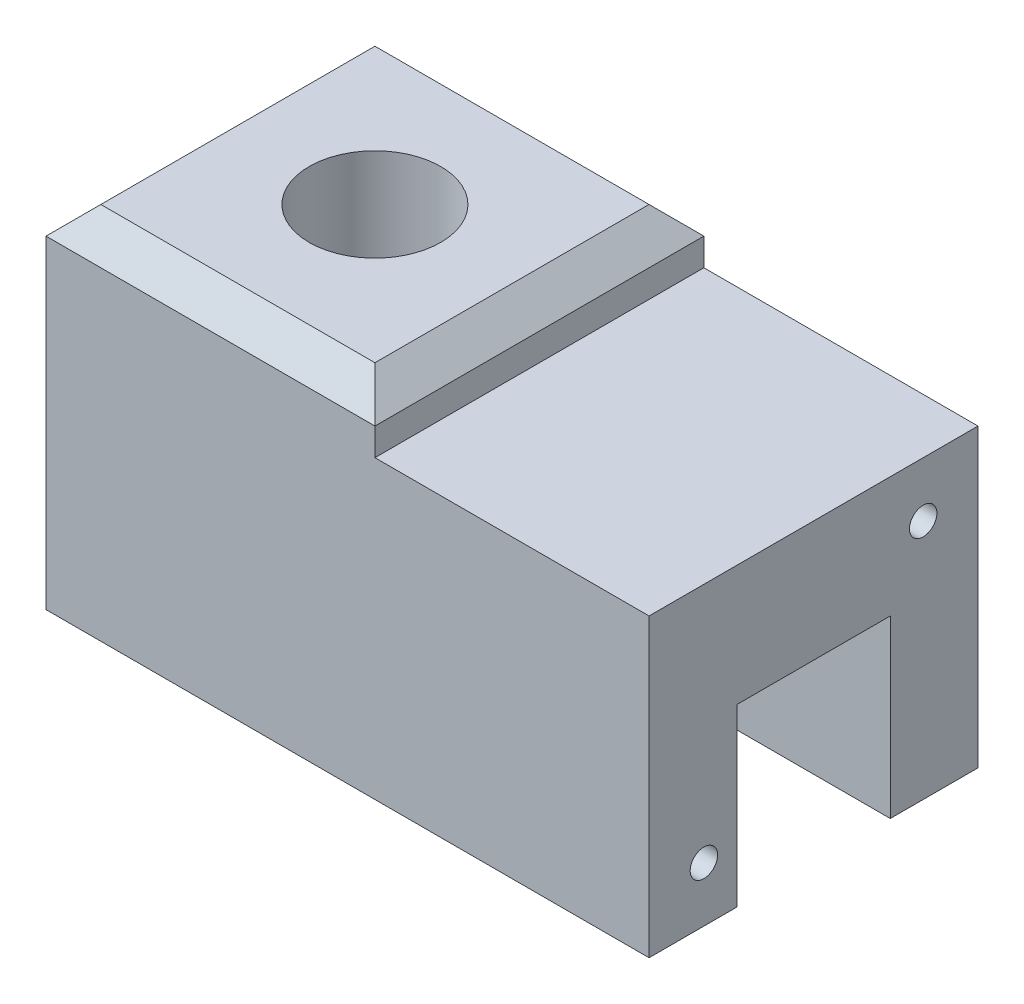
ISO-10303-21;
HEADER;
FILE_DESCRIPTION(('STEP AP214'),'2;1');
FILE_NAME('part.step','',(''),(''),'','','');
FILE_SCHEMA(('AUTOMOTIVE_DESIGN { 1 0 10303 214 1 1 1 1 }'));
ENDSEC;
DATA;
#1=APPLICATION_CONTEXT('core data for automotive mechanical design processes');
#2=APPLICATION_PROTOCOL_DEFINITION('international standard','automotive_design',2000,#1);
#3=PRODUCT_CONTEXT('',#1,'mechanical');
#4=PRODUCT('Part','Part','',(#3));
#5=PRODUCT_RELATED_PRODUCT_CATEGORY('part','',(#4));
#6=PRODUCT_DEFINITION_FORMATION('','',#4);
#7=PRODUCT_DEFINITION_CONTEXT('part definition',#1,'design');
#8=PRODUCT_DEFINITION('design','',#6,#7);
#9=PRODUCT_DEFINITION_SHAPE('','',#8);
#10=(LENGTH_UNIT() NAMED_UNIT(*) SI_UNIT(.MILLI.,.METRE.));
#11=(NAMED_UNIT(*) PLANE_ANGLE_UNIT() SI_UNIT($,.RADIAN.));
#12=(NAMED_UNIT(*) SI_UNIT($,.STERADIAN.) SOLID_ANGLE_UNIT());
#13=UNCERTAINTY_MEASURE_WITH_UNIT(LENGTH_MEASURE(1.E-05),#10,'distance_accuracy_value','');
#14=(GEOMETRIC_REPRESENTATION_CONTEXT(3) GLOBAL_UNCERTAINTY_ASSIGNED_CONTEXT((#13)) GLOBAL_UNIT_ASSIGNED_CONTEXT((#10,
#11,#12)) REPRESENTATION_CONTEXT('',''));
#15=CARTESIAN_POINT('',(0.,0.,0.));
#16=DIRECTION('',(0.,0.,1.));
#17=DIRECTION('',(1.,0.,0.));
#18=AXIS2_PLACEMENT_3D('',#15,#16,#17);
#19=CARTESIAN_POINT('',(0.,0.,60.));
#20=DIRECTION('',(0.,1.,0.));
#21=DIRECTION('',(0.,0.,1.));
#22=AXIS2_PLACEMENT_3D('',#19,#20,#21);
#23=PLANE('',#22);
#24=CARTESIAN_POINT('',(16.,0.,8.));
#25=DIRECTION('',(0.,-1.,0.));
#26=DIRECTION('',(0.,0.,-1.));
#27=AXIS2_PLACEMENT_3D('',#24,#25,#26);
#28=CIRCLE('',#27,3.375);
#29=CARTESIAN_POINT('',(16.,0.,4.625));
#30=VERTEX_POINT('',#29);
#31=EDGE_CURVE('E149',#30,#30,#28,.T.);
#32=ORIENTED_EDGE('',*,*,#31,.F.);
#33=EDGE_LOOP('',(#32));
#34=FACE_BOUND('',#33,.T.);
#35=CARTESIAN_POINT('',(94.,0.,8.));
#36=DIRECTION('',(0.,-1.,0.));
#37=DIRECTION('',(0.,0.,-1.));
#38=AXIS2_PLACEMENT_3D('',#35,#36,#37);
#39=CIRCLE('',#38,3.375);
#40=CARTESIAN_POINT('',(94.,0.,4.625));
#41=VERTEX_POINT('',#40);
#42=EDGE_CURVE('E157',#41,#41,#39,.T.);
#43=ORIENTED_EDGE('',*,*,#42,.F.);
#44=EDGE_LOOP('',(#43));
#45=FACE_BOUND('',#44,.T.);
#46=DIRECTION('',(0.,0.,-1.));
#47=VECTOR('',#46,1.);
#48=CARTESIAN_POINT('',(110.,0.,60.));
#49=LINE('',#48,#47);
#50=CARTESIAN_POINT('',(110.,0.,16.));
#51=VERTEX_POINT('',#50);
#52=CARTESIAN_POINT('',(110.,0.,0.));
#53=VERTEX_POINT('',#52);
#54=EDGE_CURVE('E244',#51,#53,#49,.T.);
#55=ORIENTED_EDGE('',*,*,#54,.F.);
#56=DIRECTION('',(-1.,0.,0.));
#57=VECTOR('',#56,1.);
#58=CARTESIAN_POINT('',(110.,0.,16.));
#59=LINE('',#58,#57);
#60=CARTESIAN_POINT('',(0.,0.,16.));
#61=VERTEX_POINT('',#60);
#62=EDGE_CURVE('E197',#51,#61,#59,.T.);
#63=ORIENTED_EDGE('',*,*,#62,.T.);
#64=DIRECTION('',(0.,0.,-1.));
#65=VECTOR('',#64,1.);
#66=CARTESIAN_POINT('',(0.,0.,60.));
#67=LINE('',#66,#65);
#68=CARTESIAN_POINT('',(0.,0.,0.));
#69=VERTEX_POINT('',#68);
#70=EDGE_CURVE('E248',#61,#69,#67,.T.);
#71=ORIENTED_EDGE('',*,*,#70,.T.);
#72=DIRECTION('',(1.,0.,0.));
#73=VECTOR('',#72,1.);
#74=CARTESIAN_POINT('',(0.,0.,0.));
#75=LINE('',#74,#73);
#76=EDGE_CURVE('E215',#69,#53,#75,.T.);
#77=ORIENTED_EDGE('',*,*,#76,.T.);
#78=EDGE_LOOP('',(#55,#63,#71,#77));
#79=FACE_BOUND('',#78,.T.);
#80=ADVANCED_FACE('F36',(#34,#45,#79),#23,.F.);
#81=CARTESIAN_POINT('',(16.,0.,52.));
#82=DIRECTION('',(0.,-1.,0.));
#83=DIRECTION('',(0.,0.,-1.));
#84=AXIS2_PLACEMENT_3D('',#81,#82,#83);
#85=CIRCLE('',#84,3.375);
#86=CARTESIAN_POINT('',(16.,0.,48.625));
#87=VERTEX_POINT('',#86);
#88=EDGE_CURVE('E163',#87,#87,#85,.T.);
#89=ORIENTED_EDGE('',*,*,#88,.F.);
#90=EDGE_LOOP('',(#89));
#91=FACE_BOUND('',#90,.T.);
#92=CARTESIAN_POINT('',(0.,0.,60.));
#93=VERTEX_POINT('',#92);
#94=CARTESIAN_POINT('',(0.,0.,44.));
#95=VERTEX_POINT('',#94);
#96=EDGE_CURVE('E249',#93,#95,#67,.T.);
#97=ORIENTED_EDGE('',*,*,#96,.T.);
#98=DIRECTION('',(-1.,0.,0.));
#99=VECTOR('',#98,1.);
#100=CARTESIAN_POINT('',(110.,0.,44.));
#101=LINE('',#100,#99);
#102=CARTESIAN_POINT('',(110.,0.,44.));
#103=VERTEX_POINT('',#102);
#104=EDGE_CURVE('E52',#103,#95,#101,.T.);
#105=ORIENTED_EDGE('',*,*,#104,.F.);
#106=CARTESIAN_POINT('',(110.,0.,60.));
#107=VERTEX_POINT('',#106);
#108=EDGE_CURVE('E245',#107,#103,#49,.T.);
#109=ORIENTED_EDGE('',*,*,#108,.F.);
#110=DIRECTION('',(1.,0.,0.));
#111=VECTOR('',#110,1.);
#112=CARTESIAN_POINT('',(0.,0.,60.));
#113=LINE('',#112,#111);
#114=EDGE_CURVE('E229',#93,#107,#113,.T.);
#115=ORIENTED_EDGE('',*,*,#114,.F.);
#116=EDGE_LOOP('',(#97,#105,#109,#115));
#117=FACE_BOUND('',#116,.T.);
#118=ADVANCED_FACE('F38',(#91,#117),#23,.F.);
#119=CARTESIAN_POINT('',(110.,0.,60.));
#120=DIRECTION('',(-1.,0.,0.));
#121=DIRECTION('',(0.,0.,1.));
#122=AXIS2_PLACEMENT_3D('',#119,#120,#121);
#123=PLANE('',#122);
#124=CARTESIAN_POINT('',(110.,10.,50.));
#125=DIRECTION('',(1.,0.,0.));
#126=DIRECTION('',(0.,0.,-1.));
#127=AXIS2_PLACEMENT_3D('',#124,#125,#126);
#128=CIRCLE('',#127,2.5);
#129=CARTESIAN_POINT('',(110.,10.,47.5));
#130=VERTEX_POINT('',#129);
#131=EDGE_CURVE('E169',#130,#130,#128,.T.);
#132=ORIENTED_EDGE('',*,*,#131,.F.);
#133=EDGE_LOOP('',(#132));
#134=FACE_BOUND('',#133,.T.);
#135=CARTESIAN_POINT('',(110.,44.,10.));
#136=DIRECTION('',(1.,0.,0.));
#137=DIRECTION('',(0.,0.,-1.));
#138=AXIS2_PLACEMENT_3D('',#135,#136,#137);
#139=CIRCLE('',#138,2.5);
#140=CARTESIAN_POINT('',(110.,44.,7.50000000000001));
#141=VERTEX_POINT('',#140);
#142=EDGE_CURVE('E175',#141,#141,#139,.T.);
#143=ORIENTED_EDGE('',*,*,#142,.F.);
#144=EDGE_LOOP('',(#143));
#145=FACE_BOUND('',#144,.T.);
#146=DIRECTION('',(0.,0.,-1.));
#147=VECTOR('',#146,1.);
#148=CARTESIAN_POINT('',(110.,32.,16.));
#149=LINE('',#148,#147);
#150=CARTESIAN_POINT('',(110.,32.,44.));
#151=VERTEX_POINT('',#150);
#152=CARTESIAN_POINT('',(110.,32.,16.));
#153=VERTEX_POINT('',#152);
#154=EDGE_CURVE('E194',#151,#153,#149,.T.);
#155=ORIENTED_EDGE('',*,*,#154,.T.);
#156=DIRECTION('',(0.,-1.,0.));
#157=VECTOR('',#156,1.);
#158=CARTESIAN_POINT('',(110.,0.,16.));
#159=LINE('',#158,#157);
#160=EDGE_CURVE('E188',#153,#51,#159,.T.);
#161=ORIENTED_EDGE('',*,*,#160,.T.);
#162=ORIENTED_EDGE('',*,*,#54,.T.);
#163=DIRECTION('',(0.,1.,0.));
#164=VECTOR('',#163,1.);
#165=CARTESIAN_POINT('',(110.,0.,0.));
#166=LINE('',#165,#164);
#167=CARTESIAN_POINT('',(110.,54.,0.));
#168=VERTEX_POINT('',#167);
#169=EDGE_CURVE('E218',#53,#168,#166,.T.);
#170=ORIENTED_EDGE('',*,*,#169,.T.);
#171=DIRECTION('',(0.,0.,-1.));
#172=VECTOR('',#171,1.);
#173=CARTESIAN_POINT('',(110.,54.,60.));
#174=LINE('',#173,#172);
#175=CARTESIAN_POINT('',(110.,54.,60.));
#176=VERTEX_POINT('',#175);
#177=EDGE_CURVE('E241',#176,#168,#174,.T.);
#178=ORIENTED_EDGE('',*,*,#177,.F.);
#179=DIRECTION('',(0.,1.,0.));
#180=VECTOR('',#179,1.);
#181=CARTESIAN_POINT('',(110.,0.,60.));
#182=LINE('',#181,#180);
#183=EDGE_CURVE('E231',#107,#176,#182,.T.);
#184=ORIENTED_EDGE('',*,*,#183,.F.);
#185=ORIENTED_EDGE('',*,*,#108,.T.);
#186=DIRECTION('',(0.,1.,0.));
#187=VECTOR('',#186,1.);
#188=CARTESIAN_POINT('',(110.,0.,44.));
#189=LINE('',#188,#187);
#190=EDGE_CURVE('E191',#103,#151,#189,.T.);
#191=ORIENTED_EDGE('',*,*,#190,.T.);
#192=EDGE_LOOP('',(#155,#161,#162,#170,#178,#184,#185,#191));
#193=FACE_BOUND('',#192,.T.);
#194=ADVANCED_FACE('F318',(#134,#145,#193),#123,.F.);
#195=CARTESIAN_POINT('',(60.,54.,60.));
#196=DIRECTION('',(0.,-1.,0.));
#197=DIRECTION('',(0.,0.,-1.));
#198=AXIS2_PLACEMENT_3D('',#195,#196,#197);
#199=PLANE('',#198);
#200=DIRECTION('',(-1.,0.,0.));
#201=VECTOR('',#200,1.);
#202=CARTESIAN_POINT('',(60.,54.,0.));
#203=LINE('',#202,#201);
#204=CARTESIAN_POINT('',(60.,54.,0.));
#205=VERTEX_POINT('',#204);
#206=EDGE_CURVE('E220',#168,#205,#203,.T.);
#207=ORIENTED_EDGE('',*,*,#206,.T.);
#208=DIRECTION('',(0.,0.,-1.));
#209=VECTOR('',#208,1.);
#210=CARTESIAN_POINT('',(60.,54.,60.));
#211=LINE('',#210,#209);
#212=CARTESIAN_POINT('',(60.,54.,60.));
#213=VERTEX_POINT('',#212);
#214=EDGE_CURVE('E238',#213,#205,#211,.T.);
#215=ORIENTED_EDGE('',*,*,#214,.F.);
#216=DIRECTION('',(-1.,0.,0.));
#217=VECTOR('',#216,1.);
#218=CARTESIAN_POINT('',(60.,54.,60.));
#219=LINE('',#218,#217);
#220=EDGE_CURVE('E233',#176,#213,#219,.T.);
#221=ORIENTED_EDGE('',*,*,#220,.F.);
#222=ORIENTED_EDGE('',*,*,#177,.T.);
#223=EDGE_LOOP('',(#207,#215,#221,#222));
#224=FACE_BOUND('',#223,.T.);
#225=ADVANCED_FACE('F333',(#224),#199,.F.);
#226=CARTESIAN_POINT('',(60.,54.,60.));
#227=DIRECTION('',(-1.,0.,0.));
#228=DIRECTION('',(0.,0.,1.));
#229=AXIS2_PLACEMENT_3D('',#226,#227,#228);
#230=PLANE('',#229);
#231=DIRECTION('',(0.,1.,0.));
#232=VECTOR('',#231,1.);
#233=CARTESIAN_POINT('',(60.,54.,0.));
#234=LINE('',#233,#232);
#235=CARTESIAN_POINT('',(60.,59.,0.));
#236=VERTEX_POINT('',#235);
#237=EDGE_CURVE('E222',#205,#236,#234,.T.);
#238=ORIENTED_EDGE('',*,*,#237,.T.);
#239=DIRECTION('',(0.,0.,1.));
#240=VECTOR('',#239,1.);
#241=CARTESIAN_POINT('',(60.,59.,60.));
#242=LINE('',#241,#240);
#243=CARTESIAN_POINT('',(60.,59.,60.));
#244=VERTEX_POINT('',#243);
#245=EDGE_CURVE('E261',#236,#244,#242,.T.);
#246=ORIENTED_EDGE('',*,*,#245,.T.);
#247=DIRECTION('',(0.,1.,0.));
#248=VECTOR('',#247,1.);
#249=CARTESIAN_POINT('',(60.,54.,60.));
#250=LINE('',#249,#248);
#251=EDGE_CURVE('E235',#213,#244,#250,.T.);
#252=ORIENTED_EDGE('',*,*,#251,.F.);
#253=ORIENTED_EDGE('',*,*,#214,.T.);
#254=EDGE_LOOP('',(#238,#246,#252,#253));
#255=FACE_BOUND('',#254,.T.);
#256=ADVANCED_FACE('F298',(#255),#230,.F.);
#257=CARTESIAN_POINT('',(0.,64.,60.));
#258=DIRECTION('',(0.,-1.,0.));
#259=DIRECTION('',(0.,0.,-1.));
#260=AXIS2_PLACEMENT_3D('',#257,#258,#259);
#261=PLANE('',#260);
#262=CARTESIAN_POINT('',(30.,64.,30.));
#263=DIRECTION('',(0.,1.,0.));
#264=DIRECTION('',(0.,0.,1.));
#265=AXIS2_PLACEMENT_3D('',#262,#263,#264);
#266=CIRCLE('',#265,12.);
#267=CARTESIAN_POINT('',(30.,64.,42.));
#268=VERTEX_POINT('',#267);
#269=EDGE_CURVE('E178',#268,#268,#266,.T.);
#270=ORIENTED_EDGE('',*,*,#269,.F.);
#271=EDGE_LOOP('',(#270));
#272=FACE_BOUND('',#271,.T.);
#273=DIRECTION('',(1.,0.,0.));
#274=VECTOR('',#273,1.);
#275=CARTESIAN_POINT('',(0.,64.,54.9999999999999));
#276=LINE('',#275,#274);
#277=CARTESIAN_POINT('',(5.00000000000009,64.,54.9999999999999));
#278=VERTEX_POINT('',#277);
#279=CARTESIAN_POINT('',(54.9999999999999,64.,54.9999999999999));
#280=VERTEX_POINT('',#279);
#281=EDGE_CURVE('E256',#278,#280,#276,.T.);
#282=ORIENTED_EDGE('',*,*,#281,.T.);
#283=DIRECTION('',(0.,0.,-1.));
#284=VECTOR('',#283,1.);
#285=CARTESIAN_POINT('',(54.9999999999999,64.,60.));
#286=LINE('',#285,#284);
#287=CARTESIAN_POINT('',(54.9999999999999,64.,5.00000000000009));
#288=VERTEX_POINT('',#287);
#289=EDGE_CURVE('E258',#280,#288,#286,.T.);
#290=ORIENTED_EDGE('',*,*,#289,.T.);
#291=DIRECTION('',(-1.,0.,0.));
#292=VECTOR('',#291,1.);
#293=CARTESIAN_POINT('',(0.,64.,5.00000000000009));
#294=LINE('',#293,#292);
#295=CARTESIAN_POINT('',(5.00000000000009,64.,5.00000000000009));
#296=VERTEX_POINT('',#295);
#297=EDGE_CURVE('E252',#288,#296,#294,.T.);
#298=ORIENTED_EDGE('',*,*,#297,.T.);
#299=DIRECTION('',(0.,0.,1.));
#300=VECTOR('',#299,1.);
#301=CARTESIAN_POINT('',(5.00000000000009,64.,60.));
#302=LINE('',#301,#300);
#303=EDGE_CURVE('E254',#296,#278,#302,.T.);
#304=ORIENTED_EDGE('',*,*,#303,.T.);
#305=EDGE_LOOP('',(#282,#290,#298,#304));
#306=FACE_BOUND('',#305,.T.);
#307=ADVANCED_FACE('F286',(#272,#306),#261,.F.);
#308=CARTESIAN_POINT('',(0.,50.,60.));
#309=DIRECTION('',(1.,0.,0.));
#310=DIRECTION('',(0.,0.,-1.));
#311=AXIS2_PLACEMENT_3D('',#308,#309,#310);
#312=PLANE('',#311);
#313=ORIENTED_EDGE('',*,*,#70,.F.);
#314=DIRECTION('',(0.,-1.,0.));
#315=VECTOR('',#314,1.);
#316=CARTESIAN_POINT('',(0.,0.,16.));
#317=LINE('',#316,#315);
#318=CARTESIAN_POINT('',(0.,32.,16.));
#319=VERTEX_POINT('',#318);
#320=EDGE_CURVE('E181',#319,#61,#317,.T.);
#321=ORIENTED_EDGE('',*,*,#320,.F.);
#322=DIRECTION('',(0.,0.,-1.));
#323=VECTOR('',#322,1.);
#324=CARTESIAN_POINT('',(0.,32.,16.));
#325=LINE('',#324,#323);
#326=CARTESIAN_POINT('',(0.,32.,44.));
#327=VERTEX_POINT('',#326);
#328=EDGE_CURVE('E185',#327,#319,#325,.T.);
#329=ORIENTED_EDGE('',*,*,#328,.F.);
#330=DIRECTION('',(0.,1.,0.));
#331=VECTOR('',#330,1.);
#332=CARTESIAN_POINT('',(0.,0.,44.));
#333=LINE('',#332,#331);
#334=EDGE_CURVE('E183',#95,#327,#333,.T.);
#335=ORIENTED_EDGE('',*,*,#334,.F.);
#336=ORIENTED_EDGE('',*,*,#96,.F.);
#337=DIRECTION('',(0.,-1.,0.));
#338=VECTOR('',#337,1.);
#339=CARTESIAN_POINT('',(0.,0.,60.));
#340=LINE('',#339,#338);
#341=CARTESIAN_POINT('',(0.,59.,60.));
#342=VERTEX_POINT('',#341);
#343=EDGE_CURVE('E227',#342,#93,#340,.T.);
#344=ORIENTED_EDGE('',*,*,#343,.F.);
#345=DIRECTION('',(0.,0.,-1.));
#346=VECTOR('',#345,1.);
#347=CARTESIAN_POINT('',(0.,59.,60.));
#348=LINE('',#347,#346);
#349=CARTESIAN_POINT('',(0.,59.,0.));
#350=VERTEX_POINT('',#349);
#351=EDGE_CURVE('E45',#342,#350,#348,.T.);
#352=ORIENTED_EDGE('',*,*,#351,.T.);
#353=DIRECTION('',(0.,-1.,0.));
#354=VECTOR('',#353,1.);
#355=CARTESIAN_POINT('',(0.,50.,0.));
#356=LINE('',#355,#354);
#357=EDGE_CURVE('E225',#350,#69,#356,.T.);
#358=ORIENTED_EDGE('',*,*,#357,.T.);
#359=EDGE_LOOP('',(#313,#321,#329,#335,#336,#344,#352,#358));
#360=FACE_BOUND('',#359,.T.);
#361=ADVANCED_FACE('F275',(#360),#312,.F.);
#362=CARTESIAN_POINT('',(0.,64.,60.));
#363=DIRECTION('',(0.,0.,-1.));
#364=DIRECTION('',(-1.,0.,0.));
#365=AXIS2_PLACEMENT_3D('',#362,#363,#364);
#366=PLANE('',#365);
#367=ORIENTED_EDGE('',*,*,#251,.T.);
#368=DIRECTION('',(-1.,0.,0.));
#369=VECTOR('',#368,1.);
#370=CARTESIAN_POINT('',(0.,59.,60.));
#371=LINE('',#370,#369);
#372=EDGE_CURVE('E264',#244,#342,#371,.T.);
#373=ORIENTED_EDGE('',*,*,#372,.T.);
#374=ORIENTED_EDGE('',*,*,#343,.T.);
#375=ORIENTED_EDGE('',*,*,#114,.T.);
#376=ORIENTED_EDGE('',*,*,#183,.T.);
#377=ORIENTED_EDGE('',*,*,#220,.T.);
#378=EDGE_LOOP('',(#367,#373,#374,#375,#376,#377));
#379=FACE_BOUND('',#378,.T.);
#380=ADVANCED_FACE('F268',(#379),#366,.F.);
#381=CARTESIAN_POINT('',(0.,64.,0.));
#382=DIRECTION('',(0.,0.,-1.));
#383=DIRECTION('',(-1.,0.,0.));
#384=AXIS2_PLACEMENT_3D('',#381,#382,#383);
#385=PLANE('',#384);
#386=ORIENTED_EDGE('',*,*,#357,.F.);
#387=DIRECTION('',(1.,0.,0.));
#388=VECTOR('',#387,1.);
#389=CARTESIAN_POINT('',(60.,59.,0.));
#390=LINE('',#389,#388);
#391=EDGE_CURVE('E11',#350,#236,#390,.T.);
#392=ORIENTED_EDGE('',*,*,#391,.T.);
#393=ORIENTED_EDGE('',*,*,#237,.F.);
#394=ORIENTED_EDGE('',*,*,#206,.F.);
#395=ORIENTED_EDGE('',*,*,#169,.F.);
#396=ORIENTED_EDGE('',*,*,#76,.F.);
#397=EDGE_LOOP('',(#386,#392,#393,#394,#395,#396));
#398=FACE_BOUND('',#397,.T.);
#399=ADVANCED_FACE('F293',(#398),#385,.T.);
#400=CARTESIAN_POINT('',(0.,59.,60.));
#401=DIRECTION('',(0.707106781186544,-0.707106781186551,0.));
#402=DIRECTION('',(0.707106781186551,0.707106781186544,0.));
#403=AXIS2_PLACEMENT_3D('',#400,#401,#402);
#404=PLANE('',#403);
#405=DIRECTION('',(-0.577350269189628,-0.577350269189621,-0.577350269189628));
#406=VECTOR('',#405,1.);
#407=CARTESIAN_POINT('',(3.33333333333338,62.3333333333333,3.33333333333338));
#408=LINE('',#407,#406);
#409=EDGE_CURVE('E209',#350,#296,#408,.F.);
#410=ORIENTED_EDGE('',*,*,#409,.F.);
#411=ORIENTED_EDGE('',*,*,#351,.F.);
#412=DIRECTION('',(0.577350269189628,0.577350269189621,-0.577350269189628));
#413=VECTOR('',#412,1.);
#414=CARTESIAN_POINT('',(0.,59.,60.));
#415=LINE('',#414,#413);
#416=EDGE_CURVE('E212',#278,#342,#415,.F.);
#417=ORIENTED_EDGE('',*,*,#416,.F.);
#418=ORIENTED_EDGE('',*,*,#303,.F.);
#419=EDGE_LOOP('',(#410,#411,#417,#418));
#420=FACE_BOUND('',#419,.T.);
#421=ADVANCED_FACE('F279',(#420),#404,.F.);
#422=CARTESIAN_POINT('',(0.,59.,60.));
#423=DIRECTION('',(0.,-0.707106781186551,-0.707106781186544));
#424=DIRECTION('',(0.,0.707106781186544,-0.707106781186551));
#425=AXIS2_PLACEMENT_3D('',#422,#423,#424);
#426=PLANE('',#425);
#427=ORIENTED_EDGE('',*,*,#416,.T.);
#428=ORIENTED_EDGE('',*,*,#372,.F.);
#429=DIRECTION('',(-0.577350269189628,0.577350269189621,-0.577350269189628));
#430=VECTOR('',#429,1.);
#431=CARTESIAN_POINT('',(39.9999999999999,78.9999999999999,39.9999999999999));
#432=LINE('',#431,#430);
#433=EDGE_CURVE('E207',#280,#244,#432,.F.);
#434=ORIENTED_EDGE('',*,*,#433,.F.);
#435=ORIENTED_EDGE('',*,*,#281,.F.);
#436=EDGE_LOOP('',(#427,#428,#434,#435));
#437=FACE_BOUND('',#436,.T.);
#438=ADVANCED_FACE('F283',(#437),#426,.F.);
#439=CARTESIAN_POINT('',(0.,64.,5.00000000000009));
#440=DIRECTION('',(0.,0.707106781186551,-0.707106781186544));
#441=DIRECTION('',(0.,0.707106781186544,0.707106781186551));
#442=AXIS2_PLACEMENT_3D('',#439,#440,#441);
#443=PLANE('',#442);
#444=ORIENTED_EDGE('',*,*,#409,.T.);
#445=ORIENTED_EDGE('',*,*,#297,.F.);
#446=DIRECTION('',(-0.577350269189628,0.577350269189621,0.577350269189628));
#447=VECTOR('',#446,1.);
#448=CARTESIAN_POINT('',(36.6666666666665,82.3333333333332,23.3333333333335));
#449=LINE('',#448,#447);
#450=EDGE_CURVE('E200',#236,#288,#449,.T.);
#451=ORIENTED_EDGE('',*,*,#450,.F.);
#452=ORIENTED_EDGE('',*,*,#391,.F.);
#453=EDGE_LOOP('',(#444,#445,#451,#452));
#454=FACE_BOUND('',#453,.T.);
#455=ADVANCED_FACE('F289',(#454),#443,.T.);
#456=CARTESIAN_POINT('',(54.9999999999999,64.,60.));
#457=DIRECTION('',(-0.707106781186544,-0.707106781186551,0.));
#458=DIRECTION('',(0.707106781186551,-0.707106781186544,0.));
#459=AXIS2_PLACEMENT_3D('',#456,#457,#458);
#460=PLANE('',#459);
#461=ORIENTED_EDGE('',*,*,#433,.T.);
#462=ORIENTED_EDGE('',*,*,#245,.F.);
#463=ORIENTED_EDGE('',*,*,#450,.T.);
#464=ORIENTED_EDGE('',*,*,#289,.F.);
#465=EDGE_LOOP('',(#461,#462,#463,#464));
#466=FACE_BOUND('',#465,.T.);
#467=ADVANCED_FACE('F301',(#466),#460,.F.);
#468=CARTESIAN_POINT('',(110.,0.,16.));
#469=DIRECTION('',(0.,0.,-1.));
#470=DIRECTION('',(0.,1.,0.));
#471=AXIS2_PLACEMENT_3D('',#468,#469,#470);
#472=PLANE('',#471);
#473=ORIENTED_EDGE('',*,*,#320,.T.);
#474=ORIENTED_EDGE('',*,*,#62,.F.);
#475=ORIENTED_EDGE('',*,*,#160,.F.);
#476=DIRECTION('',(-1.,0.,0.));
#477=VECTOR('',#476,1.);
#478=CARTESIAN_POINT('',(110.,32.,16.));
#479=LINE('',#478,#477);
#480=EDGE_CURVE('E198',#153,#319,#479,.T.);
#481=ORIENTED_EDGE('',*,*,#480,.T.);
#482=EDGE_LOOP('',(#473,#474,#475,#481));
#483=FACE_BOUND('',#482,.T.);
#484=ADVANCED_FACE('F303',(#483),#472,.F.);
#485=CARTESIAN_POINT('',(110.,32.,16.));
#486=DIRECTION('',(0.,1.,0.));
#487=DIRECTION('',(0.,0.,1.));
#488=AXIS2_PLACEMENT_3D('',#485,#486,#487);
#489=PLANE('',#488);
#490=CARTESIAN_POINT('',(30.,32.,30.));
#491=DIRECTION('',(0.,1.,0.));
#492=DIRECTION('',(0.,0.,1.));
#493=AXIS2_PLACEMENT_3D('',#490,#491,#492);
#494=CIRCLE('',#493,12.);
#495=CARTESIAN_POINT('',(30.,32.,42.));
#496=VERTEX_POINT('',#495);
#497=EDGE_CURVE('E40',#496,#496,#494,.T.);
#498=ORIENTED_EDGE('',*,*,#497,.T.);
#499=EDGE_LOOP('',(#498));
#500=FACE_BOUND('',#499,.T.);
#501=ORIENTED_EDGE('',*,*,#328,.T.);
#502=ORIENTED_EDGE('',*,*,#480,.F.);
#503=ORIENTED_EDGE('',*,*,#154,.F.);
#504=DIRECTION('',(-1.,0.,0.));
#505=VECTOR('',#504,1.);
#506=CARTESIAN_POINT('',(110.,32.,44.));
#507=LINE('',#506,#505);
#508=EDGE_CURVE('E201',#151,#327,#507,.T.);
#509=ORIENTED_EDGE('',*,*,#508,.T.);
#510=EDGE_LOOP('',(#501,#502,#503,#509));
#511=FACE_BOUND('',#510,.T.);
#512=ADVANCED_FACE('F309',(#500,#511),#489,.F.);
#513=CARTESIAN_POINT('',(110.,0.,44.));
#514=DIRECTION('',(0.,0.,1.));
#515=DIRECTION('',(1.,0.,0.));
#516=AXIS2_PLACEMENT_3D('',#513,#514,#515);
#517=PLANE('',#516);
#518=ORIENTED_EDGE('',*,*,#334,.T.);
#519=ORIENTED_EDGE('',*,*,#508,.F.);
#520=ORIENTED_EDGE('',*,*,#190,.F.);
#521=ORIENTED_EDGE('',*,*,#104,.T.);
#522=EDGE_LOOP('',(#518,#519,#520,#521));
#523=FACE_BOUND('',#522,.T.);
#524=ADVANCED_FACE('F338',(#523),#517,.F.);
#525=CARTESIAN_POINT('',(30.,0.,30.));
#526=DIRECTION('',(0.,1.,0.));
#527=DIRECTION('',(0.,0.,1.));
#528=AXIS2_PLACEMENT_3D('',#525,#526,#527);
#529=CYLINDRICAL_SURFACE('',#528,12.);
#530=ORIENTED_EDGE('',*,*,#269,.T.);
#531=EDGE_LOOP('',(#530));
#532=FACE_BOUND('',#531,.T.);
#533=ORIENTED_EDGE('',*,*,#497,.F.);
#534=EDGE_LOOP('',(#533));
#535=FACE_BOUND('',#534,.T.);
#536=ADVANCED_FACE('F346',(#532,#535),#529,.F.);
#537=CARTESIAN_POINT('',(110.,44.,10.));
#538=DIRECTION('',(1.,0.,0.));
#539=DIRECTION('',(0.,0.,-1.));
#540=AXIS2_PLACEMENT_3D('',#537,#538,#539);
#541=CYLINDRICAL_SURFACE('',#540,2.5);
#542=CARTESIAN_POINT('',(93.,44.,10.));
#543=DIRECTION('',(1.,0.,0.));
#544=DIRECTION('',(0.,0.,-1.));
#545=AXIS2_PLACEMENT_3D('',#542,#543,#544);
#546=CIRCLE('',#545,2.5);
#547=CARTESIAN_POINT('',(93.,44.,7.50000000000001));
#548=VERTEX_POINT('',#547);
#549=EDGE_CURVE('E172',#548,#548,#546,.T.);
#550=ORIENTED_EDGE('',*,*,#549,.F.);
#551=EDGE_LOOP('',(#550));
#552=FACE_BOUND('',#551,.T.);
#553=ORIENTED_EDGE('',*,*,#142,.T.);
#554=EDGE_LOOP('',(#553));
#555=FACE_BOUND('',#554,.T.);
#556=ADVANCED_FACE('F352',(#552,#555),#541,.F.);
#557=CARTESIAN_POINT('',(93.,44.,10.));
#558=DIRECTION('',(1.,0.,0.));
#559=DIRECTION('',(0.,0.,-1.));
#560=AXIS2_PLACEMENT_3D('',#557,#558,#559);
#561=CONICAL_SURFACE('',#560,2.5,1.02974425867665);
#562=CARTESIAN_POINT('',(91.4978484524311,44.,10.));
#563=VERTEX_POINT('',#562);
#564=VERTEX_LOOP('',#563);
#565=FACE_BOUND('',#564,.T.);
#566=ORIENTED_EDGE('',*,*,#549,.T.);
#567=EDGE_LOOP('',(#566));
#568=FACE_BOUND('',#567,.T.);
#569=ADVANCED_FACE('F356',(#565,#568),#561,.F.);
#570=CARTESIAN_POINT('',(110.,10.,50.));
#571=DIRECTION('',(1.,0.,0.));
#572=DIRECTION('',(0.,0.,-1.));
#573=AXIS2_PLACEMENT_3D('',#570,#571,#572);
#574=CYLINDRICAL_SURFACE('',#573,2.5);
#575=CARTESIAN_POINT('',(93.,10.,50.));
#576=DIRECTION('',(1.,0.,0.));
#577=DIRECTION('',(0.,0.,-1.));
#578=AXIS2_PLACEMENT_3D('',#575,#576,#577);
#579=CIRCLE('',#578,2.5);
#580=CARTESIAN_POINT('',(93.,10.,47.5));
#581=VERTEX_POINT('',#580);
#582=EDGE_CURVE('E166',#581,#581,#579,.T.);
#583=ORIENTED_EDGE('',*,*,#582,.F.);
#584=EDGE_LOOP('',(#583));
#585=FACE_BOUND('',#584,.T.);
#586=ORIENTED_EDGE('',*,*,#131,.T.);
#587=EDGE_LOOP('',(#586));
#588=FACE_BOUND('',#587,.T.);
#589=ADVANCED_FACE('F360',(#585,#588),#574,.F.);
#590=CARTESIAN_POINT('',(93.,10.,50.));
#591=DIRECTION('',(1.,0.,0.));
#592=DIRECTION('',(0.,0.,-1.));
#593=AXIS2_PLACEMENT_3D('',#590,#591,#592);
#594=CONICAL_SURFACE('',#593,2.5,1.02974425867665);
#595=CARTESIAN_POINT('',(91.4978484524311,9.99999999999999,50.));
#596=VERTEX_POINT('',#595);
#597=VERTEX_LOOP('',#596);
#598=FACE_BOUND('',#597,.T.);
#599=ORIENTED_EDGE('',*,*,#582,.T.);
#600=EDGE_LOOP('',(#599));
#601=FACE_BOUND('',#600,.T.);
#602=ADVANCED_FACE('F364',(#598,#601),#594,.F.);
#603=CARTESIAN_POINT('',(16.,0.,52.));
#604=DIRECTION('',(0.,-1.,0.));
#605=DIRECTION('',(0.,0.,-1.));
#606=AXIS2_PLACEMENT_3D('',#603,#604,#605);
#607=CYLINDRICAL_SURFACE('',#606,3.375);
#608=CARTESIAN_POINT('',(16.,22.25,52.));
#609=DIRECTION('',(0.,-1.,0.));
#610=DIRECTION('',(0.,0.,-1.));
#611=AXIS2_PLACEMENT_3D('',#608,#609,#610);
#612=CIRCLE('',#611,3.375);
#613=CARTESIAN_POINT('',(16.,22.25,48.625));
#614=VERTEX_POINT('',#613);
#615=EDGE_CURVE('E160',#614,#614,#612,.T.);
#616=ORIENTED_EDGE('',*,*,#615,.F.);
#617=EDGE_LOOP('',(#616));
#618=FACE_BOUND('',#617,.T.);
#619=ORIENTED_EDGE('',*,*,#88,.T.);
#620=EDGE_LOOP('',(#619));
#621=FACE_BOUND('',#620,.T.);
#622=ADVANCED_FACE('F368',(#618,#621),#607,.F.);
#623=CARTESIAN_POINT('',(16.,22.25,52.));
#624=DIRECTION('',(0.,-1.,0.));
#625=DIRECTION('',(0.,0.,-1.));
#626=AXIS2_PLACEMENT_3D('',#623,#624,#625);
#627=CONICAL_SURFACE('',#626,3.375,1.02974425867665);
#628=CARTESIAN_POINT('',(16.,24.277904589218,52.));
#629=VERTEX_POINT('',#628);
#630=VERTEX_LOOP('',#629);
#631=FACE_BOUND('',#630,.T.);
#632=ORIENTED_EDGE('',*,*,#615,.T.);
#633=EDGE_LOOP('',(#632));
#634=FACE_BOUND('',#633,.T.);
#635=ADVANCED_FACE('F372',(#631,#634),#627,.F.);
#636=CARTESIAN_POINT('',(94.,0.,8.));
#637=DIRECTION('',(0.,-1.,0.));
#638=DIRECTION('',(0.,0.,-1.));
#639=AXIS2_PLACEMENT_3D('',#636,#637,#638);
#640=CYLINDRICAL_SURFACE('',#639,3.375);
#641=CARTESIAN_POINT('',(94.,28.,8.));
#642=DIRECTION('',(0.,-1.,0.));
#643=DIRECTION('',(0.,0.,-1.));
#644=AXIS2_PLACEMENT_3D('',#641,#642,#643);
#645=CIRCLE('',#644,3.37499999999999);
#646=CARTESIAN_POINT('',(94.,28.,4.62500000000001));
#647=VERTEX_POINT('',#646);
#648=EDGE_CURVE('E152',#647,#647,#645,.T.);
#649=ORIENTED_EDGE('',*,*,#648,.F.);
#650=EDGE_LOOP('',(#649));
#651=FACE_BOUND('',#650,.T.);
#652=ORIENTED_EDGE('',*,*,#42,.T.);
#653=EDGE_LOOP('',(#652));
#654=FACE_BOUND('',#653,.T.);
#655=ADVANCED_FACE('F376',(#651,#654),#640,.F.);
#656=CARTESIAN_POINT('',(94.,28.,8.));
#657=DIRECTION('',(0.,-1.,0.));
#658=DIRECTION('',(0.,0.,-1.));
#659=AXIS2_PLACEMENT_3D('',#656,#657,#658);
#660=CONICAL_SURFACE('',#659,3.37499999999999,1.02974425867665);
#661=CARTESIAN_POINT('',(94.,30.027904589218,8.));
#662=VERTEX_POINT('',#661);
#663=VERTEX_LOOP('',#662);
#664=FACE_BOUND('',#663,.T.);
#665=ORIENTED_EDGE('',*,*,#648,.T.);
#666=EDGE_LOOP('',(#665));
#667=FACE_BOUND('',#666,.T.);
#668=ADVANCED_FACE('F380',(#664,#667),#660,.F.);
#669=CARTESIAN_POINT('',(16.,0.,8.));
#670=DIRECTION('',(0.,-1.,0.));
#671=DIRECTION('',(0.,0.,-1.));
#672=AXIS2_PLACEMENT_3D('',#669,#670,#671);
#673=CYLINDRICAL_SURFACE('',#672,3.37499999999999);
#674=CARTESIAN_POINT('',(16.,28.,8.));
#675=DIRECTION('',(0.,-1.,0.));
#676=DIRECTION('',(0.,0.,-1.));
#677=AXIS2_PLACEMENT_3D('',#674,#675,#676);
#678=CIRCLE('',#677,3.37499999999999);
#679=CARTESIAN_POINT('',(16.,28.,4.62500000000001));
#680=VERTEX_POINT('',#679);
#681=EDGE_CURVE('E147',#680,#680,#678,.T.);
#682=ORIENTED_EDGE('',*,*,#681,.F.);
#683=EDGE_LOOP('',(#682));
#684=FACE_BOUND('',#683,.T.);
#685=ORIENTED_EDGE('',*,*,#31,.T.);
#686=EDGE_LOOP('',(#685));
#687=FACE_BOUND('',#686,.T.);
#688=ADVANCED_FACE('F143',(#684,#687),#673,.F.);
#689=CARTESIAN_POINT('',(16.,28.,8.));
#690=DIRECTION('',(0.,-1.,0.));
#691=DIRECTION('',(0.,0.,-1.));
#692=AXIS2_PLACEMENT_3D('',#689,#690,#691);
#693=CONICAL_SURFACE('',#692,3.37499999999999,1.02974425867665);
#694=CARTESIAN_POINT('',(16.,30.027904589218,8.));
#695=VERTEX_POINT('',#694);
#696=VERTEX_LOOP('',#695);
#697=FACE_BOUND('',#696,.T.);
#698=ORIENTED_EDGE('',*,*,#681,.T.);
#699=EDGE_LOOP('',(#698));
#700=FACE_BOUND('',#699,.T.);
#701=ADVANCED_FACE('F140',(#697,#700),#693,.F.);
#702=CLOSED_SHELL('',(#80,#118,#194,#225,#256,#307,#361,#380,#399,#421,#438,#455,#467,#484,#512,
#524,#536,#556,#569,#589,#602,#622,#635,#655,#668,#688,#701));
#703=MANIFOLD_SOLID_BREP('B2',#702);
#704=ADVANCED_BREP_SHAPE_REPRESENTATION('',(#18,#703),#14);
#705=SHAPE_DEFINITION_REPRESENTATION(#9,#704);
ENDSEC;
END-ISO-10303-21;
